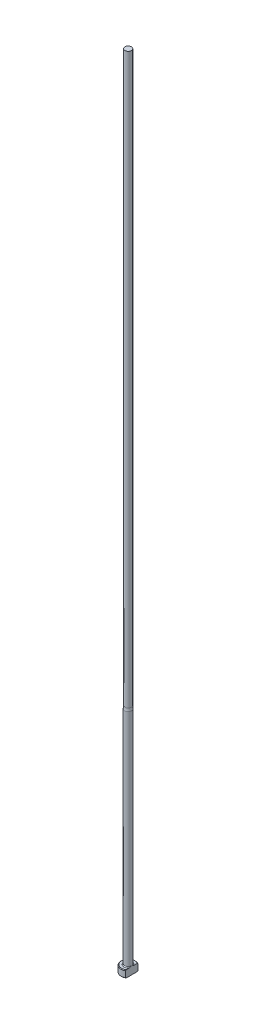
ISO-10303-21;
HEADER;
FILE_DESCRIPTION(('STEP AP214'),'2;1');
FILE_NAME('part.step','',(''),(''),'','','');
FILE_SCHEMA(('AUTOMOTIVE_DESIGN { 1 0 10303 214 1 1 1 1 }'));
ENDSEC;
DATA;
#1=APPLICATION_CONTEXT('core data for automotive mechanical design processes');
#2=APPLICATION_PROTOCOL_DEFINITION('international standard','automotive_design',2000,#1);
#3=PRODUCT_CONTEXT('',#1,'mechanical');
#4=PRODUCT('Part','Part','',(#3));
#5=PRODUCT_RELATED_PRODUCT_CATEGORY('part','',(#4));
#6=PRODUCT_DEFINITION_FORMATION('','',#4);
#7=PRODUCT_DEFINITION_CONTEXT('part definition',#1,'design');
#8=PRODUCT_DEFINITION('design','',#6,#7);
#9=PRODUCT_DEFINITION_SHAPE('','',#8);
#10=(LENGTH_UNIT() NAMED_UNIT(*) SI_UNIT(.MILLI.,.METRE.));
#11=(NAMED_UNIT(*) PLANE_ANGLE_UNIT() SI_UNIT($,.RADIAN.));
#12=(NAMED_UNIT(*) SI_UNIT($,.STERADIAN.) SOLID_ANGLE_UNIT());
#13=UNCERTAINTY_MEASURE_WITH_UNIT(LENGTH_MEASURE(1.E-05),#10,'distance_accuracy_value','');
#14=(GEOMETRIC_REPRESENTATION_CONTEXT(3) GLOBAL_UNCERTAINTY_ASSIGNED_CONTEXT((#13)) GLOBAL_UNIT_ASSIGNED_CONTEXT((#10,
#11,#12)) REPRESENTATION_CONTEXT('',''));
#15=CARTESIAN_POINT('',(0.,0.,0.));
#16=DIRECTION('',(0.,0.,1.));
#17=DIRECTION('',(1.,0.,0.));
#18=AXIS2_PLACEMENT_3D('',#15,#16,#17);
#19=CARTESIAN_POINT('',(-3.17499999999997,3.175,0.));
#20=DIRECTION('',(0.,1.,0.));
#21=DIRECTION('',(0.,0.,1.));
#22=AXIS2_PLACEMENT_3D('',#19,#20,#21);
#23=PLANE('',#22);
#24=CARTESIAN_POINT('',(0.,3.175,0.));
#25=DIRECTION('',(0.,1.,0.));
#26=DIRECTION('',(0.,0.,1.));
#27=AXIS2_PLACEMENT_3D('',#24,#25,#26);
#28=CIRCLE('',#27,2.92099999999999);
#29=CARTESIAN_POINT('',(1.58749999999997,3.175,-2.4519552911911));
#30=VERTEX_POINT('',#29);
#31=CARTESIAN_POINT('',(1.58749999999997,3.175,2.4519552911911));
#32=VERTEX_POINT('',#31);
#33=EDGE_CURVE('E105',#30,#32,#28,.T.);
#34=ORIENTED_EDGE('',*,*,#33,.T.);
#35=DIRECTION('',(0.,0.,1.));
#36=VECTOR('',#35,1.);
#37=CARTESIAN_POINT('',(1.58749999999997,3.17499999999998,2.74963065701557));
#38=LINE('',#37,#36);
#39=CARTESIAN_POINT('',(1.58749999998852,3.175,1.16397422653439));
#40=VERTEX_POINT('',#39);
#41=EDGE_CURVE('E126',#40,#32,#38,.T.);
#42=ORIENTED_EDGE('',*,*,#41,.F.);
#43=CARTESIAN_POINT('',(0.,3.175,0.));
#44=DIRECTION('',(0.,1.,0.));
#45=DIRECTION('',(0.,0.,1.));
#46=AXIS2_PLACEMENT_3D('',#43,#44,#45);
#47=CIRCLE('',#46,1.96849999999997);
#48=CARTESIAN_POINT('',(1.58749999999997,3.175,-1.16397422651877));
#49=VERTEX_POINT('',#48);
#50=EDGE_CURVE('E11',#40,#49,#47,.F.);
#51=ORIENTED_EDGE('',*,*,#50,.T.);
#52=EDGE_CURVE('E52',#30,#49,#38,.T.);
#53=ORIENTED_EDGE('',*,*,#52,.F.);
#54=EDGE_LOOP('',(#34,#42,#51,#53));
#55=FACE_BOUND('',#54,.T.);
#56=ADVANCED_FACE('F32',(#55),#23,.T.);
#57=CARTESIAN_POINT('',(0.,259.958771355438,0.));
#58=DIRECTION('',(0.,1.,0.));
#59=DIRECTION('',(0.,0.,1.));
#60=AXIS2_PLACEMENT_3D('',#57,#58,#59);
#61=CYLINDRICAL_SURFACE('',#60,3.17499999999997);
#62=CARTESIAN_POINT('',(0.,2.92100000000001,0.));
#63=DIRECTION('',(0.,1.,0.));
#64=DIRECTION('',(0.,0.,1.));
#65=AXIS2_PLACEMENT_3D('',#62,#63,#64);
#66=CIRCLE('',#65,3.17499999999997);
#67=CARTESIAN_POINT('',(1.58749999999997,2.92100000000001,2.74963065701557));
#68=VERTEX_POINT('',#67);
#69=CARTESIAN_POINT('',(1.58749999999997,2.92100000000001,-2.74963065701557));
#70=VERTEX_POINT('',#69);
#71=EDGE_CURVE('E98',#68,#70,#66,.F.);
#72=ORIENTED_EDGE('',*,*,#71,.T.);
#73=DIRECTION('',(0.,-1.,0.));
#74=VECTOR('',#73,1.);
#75=CARTESIAN_POINT('',(1.58749999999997,355.601,-2.74963065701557));
#76=LINE('',#75,#74);
#77=CARTESIAN_POINT('',(1.58749999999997,0.253999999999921,-2.74963065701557));
#78=VERTEX_POINT('',#77);
#79=EDGE_CURVE('E141',#70,#78,#76,.T.);
#80=ORIENTED_EDGE('',*,*,#79,.T.);
#81=CARTESIAN_POINT('',(0.,0.253999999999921,0.));
#82=DIRECTION('',(0.,-1.,0.));
#83=DIRECTION('',(0.,0.,-1.));
#84=AXIS2_PLACEMENT_3D('',#81,#82,#83);
#85=CIRCLE('',#84,3.17499999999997);
#86=CARTESIAN_POINT('',(1.58749999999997,0.253999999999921,2.74963065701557));
#87=VERTEX_POINT('',#86);
#88=EDGE_CURVE('E95',#78,#87,#85,.F.);
#89=ORIENTED_EDGE('',*,*,#88,.T.);
#90=DIRECTION('',(0.,-1.,0.));
#91=VECTOR('',#90,1.);
#92=CARTESIAN_POINT('',(1.58749999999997,355.601,2.74963065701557));
#93=LINE('',#92,#91);
#94=EDGE_CURVE('E88',#68,#87,#93,.T.);
#95=ORIENTED_EDGE('',*,*,#94,.F.);
#96=EDGE_LOOP('',(#72,#80,#89,#95));
#97=FACE_BOUND('',#96,.T.);
#98=ADVANCED_FACE('F191',(#97),#61,.T.);
#99=CARTESIAN_POINT('',(0.,0.,0.));
#100=DIRECTION('',(0.,-1.,0.));
#101=DIRECTION('',(0.,0.,-1.));
#102=AXIS2_PLACEMENT_3D('',#99,#100,#101);
#103=PLANE('',#102);
#104=CARTESIAN_POINT('',(0.,0.,0.));
#105=DIRECTION('',(0.,-1.,0.));
#106=DIRECTION('',(0.,0.,-1.));
#107=AXIS2_PLACEMENT_3D('',#104,#105,#106);
#108=CIRCLE('',#107,2.92100000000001);
#109=CARTESIAN_POINT('',(1.58749999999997,0.,2.45195529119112));
#110=VERTEX_POINT('',#109);
#111=CARTESIAN_POINT('',(1.58749999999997,0.,-2.45195529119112));
#112=VERTEX_POINT('',#111);
#113=EDGE_CURVE('E93',#110,#112,#108,.T.);
#114=ORIENTED_EDGE('',*,*,#113,.T.);
#115=DIRECTION('',(0.,0.,1.));
#116=VECTOR('',#115,1.);
#117=CARTESIAN_POINT('',(1.58749999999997,0.,2.74963065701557));
#118=LINE('',#117,#116);
#119=EDGE_CURVE('E78',#112,#110,#118,.T.);
#120=ORIENTED_EDGE('',*,*,#119,.T.);
#121=EDGE_LOOP('',(#114,#120));
#122=FACE_BOUND('',#121,.T.);
#123=ADVANCED_FACE('F97',(#122),#103,.T.);
#124=CARTESIAN_POINT('',(0.,3.17499999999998,0.));
#125=DIRECTION('',(0.,-1.,0.));
#126=DIRECTION('',(0.,0.,-1.));
#127=AXIS2_PLACEMENT_3D('',#124,#125,#126);
#128=CONICAL_SURFACE('',#127,2.92100000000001,0.785398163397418);
#129=ORIENTED_EDGE('',*,*,#71,.F.);
#130=CARTESIAN_POINT('',(1.58749999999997,-0.161620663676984,-6.0529050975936));
#131=CARTESIAN_POINT('',(1.58749999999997,-0.0288893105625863,-5.91567682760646));
#132=CARTESIAN_POINT('',(1.58749999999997,0.103699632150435,-5.77831035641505));
#133=CARTESIAN_POINT('',(1.58749999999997,0.368508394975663,-5.50321874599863));
#134=CARTESIAN_POINT('',(1.58749999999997,0.5007282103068,-5.3654936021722));
#135=CARTESIAN_POINT('',(1.58749999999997,0.764778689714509,-5.08953516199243));
#136=CARTESIAN_POINT('',(1.58749999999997,0.896609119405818,-4.95130164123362));
#137=CARTESIAN_POINT('',(1.58749999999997,1.15968706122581,-4.67428233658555));
#138=CARTESIAN_POINT('',(1.58749999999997,1.29093457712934,-4.5354965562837));
#139=CARTESIAN_POINT('',(1.58749999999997,1.55007705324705,-4.25997724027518));
#140=CARTESIAN_POINT('',(1.58749999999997,1.67798684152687,-4.12325766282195));
#141=CARTESIAN_POINT('',(1.58749999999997,1.9328486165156,-3.84892898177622));
#142=CARTESIAN_POINT('',(1.58749999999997,2.05980060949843,-3.71131988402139));
#143=CARTESIAN_POINT('',(1.58749999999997,2.31237508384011,-3.43493978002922));
#144=CARTESIAN_POINT('',(1.58749999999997,2.43799784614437,-3.29616903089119));
#145=CARTESIAN_POINT('',(1.58749999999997,2.68741369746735,-3.01699558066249));
#146=CARTESIAN_POINT('',(1.58749999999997,2.81120686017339,-2.8765929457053));
#147=CARTESIAN_POINT('',(1.58749999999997,3.00875865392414,-2.64816703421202));
#148=CARTESIAN_POINT('',(1.58749999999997,3.08336151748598,-2.56087478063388));
#149=CARTESIAN_POINT('',(1.58749999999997,3.23123871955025,-2.385154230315));
#150=CARTESIAN_POINT('',(1.58749999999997,3.30451292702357,-2.29672582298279));
#151=CARTESIAN_POINT('',(1.58749999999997,3.45004422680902,-2.11747400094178));
#152=CARTESIAN_POINT('',(1.58749999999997,3.52228237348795,-2.02663514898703));
#153=CARTESIAN_POINT('',(1.58749999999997,3.66423097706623,-1.84302524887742));
#154=CARTESIAN_POINT('',(1.58749999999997,3.73394203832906,-1.75025467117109));
#155=CARTESIAN_POINT('',(1.58749999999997,3.87080633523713,-1.56067475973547));
#156=CARTESIAN_POINT('',(1.58749999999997,3.93790459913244,-1.46382547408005));
#157=CARTESIAN_POINT('',(1.58749999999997,4.06669147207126,-1.26632594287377));
#158=CARTESIAN_POINT('',(1.58749999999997,4.12837264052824,-1.16567073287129));
#159=CARTESIAN_POINT('',(1.58749999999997,4.21402252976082,-1.01165766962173));
#160=CARTESIAN_POINT('',(1.58749999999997,4.2412792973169,-0.960142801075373));
#161=CARTESIAN_POINT('',(1.58749999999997,4.29309798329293,-0.85578092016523));
#162=CARTESIAN_POINT('',(1.58749999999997,4.3176594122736,-0.802933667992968));
#163=CARTESIAN_POINT('',(1.58749999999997,4.38614656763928,-0.642461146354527));
#164=CARTESIAN_POINT('',(1.58749999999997,4.42510149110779,-0.532518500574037));
#165=CARTESIAN_POINT('',(1.58749999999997,4.46726244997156,-0.367680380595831));
#166=CARTESIAN_POINT('',(1.58749999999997,4.47844427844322,-0.314802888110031));
#167=CARTESIAN_POINT('',(1.58749999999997,4.49576654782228,-0.208209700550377));
#168=CARTESIAN_POINT('',(1.58749999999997,4.50190743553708,-0.154494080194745));
#169=CARTESIAN_POINT('',(1.58749999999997,4.50871296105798,-0.0468792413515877));
#170=CARTESIAN_POINT('',(1.58749999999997,4.50939451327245,0.00701889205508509));
#171=CARTESIAN_POINT('',(1.58749999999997,4.5052767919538,0.114606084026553));
#172=CARTESIAN_POINT('',(1.58749999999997,4.5004770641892,0.16829512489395));
#173=CARTESIAN_POINT('',(1.58749999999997,4.48579689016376,0.274485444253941));
#174=CARTESIAN_POINT('',(1.58749999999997,4.47596081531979,0.326992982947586));
#175=CARTESIAN_POINT('',(1.58749999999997,4.4518180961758,0.430974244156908));
#176=CARTESIAN_POINT('',(1.58749999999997,4.43750969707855,0.482447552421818));
#177=CARTESIAN_POINT('',(1.58749999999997,4.40502489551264,0.58446088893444));
#178=CARTESIAN_POINT('',(1.58749999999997,4.38682724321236,0.634994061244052));
#179=CARTESIAN_POINT('',(1.58749999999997,4.34729308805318,0.734789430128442));
#180=CARTESIAN_POINT('',(1.58749999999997,4.32595722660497,0.784051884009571));
#181=CARTESIAN_POINT('',(1.58749999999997,4.25791922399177,0.93054934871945));
#182=CARTESIAN_POINT('',(1.58749999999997,4.20736047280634,1.02598802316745));
#183=CARTESIAN_POINT('',(1.58749999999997,4.09955451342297,1.21304313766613));
#184=CARTESIAN_POINT('',(1.58749999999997,4.04229912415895,1.30465471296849));
#185=CARTESIAN_POINT('',(1.58749999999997,3.92308746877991,1.48526211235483));
#186=CARTESIAN_POINT('',(1.58749999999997,3.86111349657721,1.57424615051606));
#187=CARTESIAN_POINT('',(1.58749999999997,3.73408621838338,1.74990003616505));
#188=CARTESIAN_POINT('',(1.58749999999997,3.66903444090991,1.83657099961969));
#189=CARTESIAN_POINT('',(1.58749999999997,3.53583371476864,2.009317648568));
#190=CARTESIAN_POINT('',(1.58749999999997,3.46765527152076,2.09537048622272));
#191=CARTESIAN_POINT('',(1.58749999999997,3.32960643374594,2.26611736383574));
#192=CARTESIAN_POINT('',(1.58749999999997,3.25973586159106,2.35081125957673));
#193=CARTESIAN_POINT('',(1.58749999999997,3.04858139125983,2.60290121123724));
#194=CARTESIAN_POINT('',(1.58749999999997,2.90542388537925,2.7687253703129));
#195=CARTESIAN_POINT('',(1.58749999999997,2.64069522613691,3.06970913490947));
#196=CARTESIAN_POINT('',(1.58749999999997,2.5195945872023,3.20528660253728));
#197=CARTESIAN_POINT('',(1.58749999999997,2.27590400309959,3.47510321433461));
#198=CARTESIAN_POINT('',(1.58749999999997,2.1533140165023,3.60934232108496));
#199=CARTESIAN_POINT('',(1.58749999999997,1.9069423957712,3.87695374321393));
#200=CARTESIAN_POINT('',(1.58749999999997,1.78315974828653,4.01032512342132));
#201=CARTESIAN_POINT('',(1.58749999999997,1.53478104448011,4.2763088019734));
#202=CARTESIAN_POINT('',(1.58749999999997,1.41018498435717,4.40892109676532));
#203=CARTESIAN_POINT('',(1.58749999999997,1.04574684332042,4.79499418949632));
#204=CARTESIAN_POINT('',(1.58749999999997,0.805076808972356,5.04767313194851));
#205=CARTESIAN_POINT('',(1.58749999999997,0.44312150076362,5.42550911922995));
#206=CARTESIAN_POINT('',(1.58749999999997,0.322378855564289,5.55118772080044));
#207=CARTESIAN_POINT('',(1.58749999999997,0.0805914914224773,5.8022520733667));
#208=CARTESIAN_POINT('',(1.58749999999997,-0.0404532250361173,5.92763782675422));
#209=CARTESIAN_POINT('',(1.58749999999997,-0.161620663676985,6.0529050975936));
#210=B_SPLINE_CURVE_WITH_KNOTS('',3,(#130,#131,#132,#133,#134,#135,#136,#137,#138,#139,#140,
#141,#142,#143,#144,#145,#146,#147,#148,#149,#150,#151,#152,#153,#154,#155,#156,#157,#158,#159,
#160,#161,#162,#163,#164,#165,#166,#167,#168,#169,#170,#171,#172,#173,#174,#175,#176,#177,#178,
#179,#180,#181,#182,#183,#184,#185,#186,#187,#188,#189,#190,#191,#192,#193,#194,#195,#196,#197,
#198,#199,#200,#201,#202,#203,#204,#205,#206,#207,#208,#209),.UNSPECIFIED.,.F.,.F.,(4,2,2,2,2,2,
2,2,2,2,2,2,2,2,2,2,2,2,2,2,2,2,2,2,2,2,2,2,2,2,2,2,2,2,2,2,2,2,2,4),(0.,0.572750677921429,
1.14550874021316,1.71856057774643,2.29160869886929,2.85328006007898,3.41494773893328,
3.97649423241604,4.53801804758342,4.88249307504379,5.2270018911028,5.57515326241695,
5.92322081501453,6.27657800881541,6.63041319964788,6.80518126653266,6.97998101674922,
7.32824262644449,7.49018491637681,7.65211285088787,7.81353889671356,7.97497832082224,
8.13501929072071,8.29512313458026,8.45612518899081,8.61709438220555,8.94062993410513,
9.26456495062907,9.58978187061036,9.91483894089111,10.2441741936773,10.5735441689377,
11.2306812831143,11.7760337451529,12.3214014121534,12.8672825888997,13.4131663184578,
14.4600164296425,14.9828595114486,15.505698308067),.UNSPECIFIED.);
#211=EDGE_CURVE('E118',#32,#68,#210,.T.);
#212=ORIENTED_EDGE('',*,*,#211,.F.);
#213=ORIENTED_EDGE('',*,*,#33,.F.);
#214=EDGE_CURVE('E117',#70,#30,#210,.T.);
#215=ORIENTED_EDGE('',*,*,#214,.F.);
#216=EDGE_LOOP('',(#129,#212,#213,#215));
#217=FACE_BOUND('',#216,.T.);
#218=ADVANCED_FACE('F162',(#217),#128,.T.);
#219=CARTESIAN_POINT('',(0.,0.253999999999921,0.));
#220=DIRECTION('',(0.,1.,0.));
#221=DIRECTION('',(0.,0.,1.));
#222=AXIS2_PLACEMENT_3D('',#219,#220,#221);
#223=CONICAL_SURFACE('',#222,3.17499999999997,0.785398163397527);
#224=ORIENTED_EDGE('',*,*,#88,.F.);
#225=CARTESIAN_POINT('',(1.58749999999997,3.33662066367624,6.0529050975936));
#226=CARTESIAN_POINT('',(1.58749999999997,3.20388931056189,5.91567682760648));
#227=CARTESIAN_POINT('',(1.58749999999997,3.07130036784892,5.7783103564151));
#228=CARTESIAN_POINT('',(1.58749999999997,2.80649160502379,5.50321874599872));
#229=CARTESIAN_POINT('',(1.58749999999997,2.6742717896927,5.36549360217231));
#230=CARTESIAN_POINT('',(1.58749999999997,2.41022131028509,5.08953516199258));
#231=CARTESIAN_POINT('',(1.58749999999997,2.27839088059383,4.95130164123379));
#232=CARTESIAN_POINT('',(1.58749999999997,2.01531293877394,4.67428233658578));
#233=CARTESIAN_POINT('',(1.58749999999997,1.88406542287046,4.53549655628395));
#234=CARTESIAN_POINT('',(1.58749999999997,1.62492294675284,4.25997724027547));
#235=CARTESIAN_POINT('',(1.58749999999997,1.49701315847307,4.12325766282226));
#236=CARTESIAN_POINT('',(1.58749999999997,1.24215138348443,3.84892898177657));
#237=CARTESIAN_POINT('',(1.58749999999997,1.11519939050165,3.71131988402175));
#238=CARTESIAN_POINT('',(1.58749999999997,0.862624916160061,3.43493978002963));
#239=CARTESIAN_POINT('',(1.58749999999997,0.737002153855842,3.29616903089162));
#240=CARTESIAN_POINT('',(1.58749999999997,0.487586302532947,3.01699558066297));
#241=CARTESIAN_POINT('',(1.58749999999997,0.363793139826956,2.8765929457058));
#242=CARTESIAN_POINT('',(1.58749999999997,0.166241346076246,2.64816703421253));
#243=CARTESIAN_POINT('',(1.58749999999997,0.0916384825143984,2.56087478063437));
#244=CARTESIAN_POINT('',(1.58749999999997,-0.0562387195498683,2.38515423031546));
#245=CARTESIAN_POINT('',(1.58749999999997,-0.129512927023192,2.29672582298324));
#246=CARTESIAN_POINT('',(1.58749999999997,-0.275044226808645,2.1174740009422));
#247=CARTESIAN_POINT('',(1.58749999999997,-0.347282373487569,2.02663514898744));
#248=CARTESIAN_POINT('',(1.58749999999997,-0.489230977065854,1.8430252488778));
#249=CARTESIAN_POINT('',(1.58749999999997,-0.558942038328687,1.75025467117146));
#250=CARTESIAN_POINT('',(1.58749999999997,-0.695806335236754,1.5606747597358));
#251=CARTESIAN_POINT('',(1.58749999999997,-0.762904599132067,1.46382547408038));
#252=CARTESIAN_POINT('',(1.58749999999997,-0.89169147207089,1.26632594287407));
#253=CARTESIAN_POINT('',(1.58749999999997,-0.953372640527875,1.16567073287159));
#254=CARTESIAN_POINT('',(1.58749999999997,-1.03902252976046,1.01165766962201));
#255=CARTESIAN_POINT('',(1.58749999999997,-1.06627929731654,0.960142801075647));
#256=CARTESIAN_POINT('',(1.58749999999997,-1.11809798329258,0.855780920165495));
#257=CARTESIAN_POINT('',(1.58749999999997,-1.14265941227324,0.802933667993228));
#258=CARTESIAN_POINT('',(1.58749999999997,-1.21114656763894,0.642461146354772));
#259=CARTESIAN_POINT('',(1.58749999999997,-1.25010149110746,0.532518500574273));
#260=CARTESIAN_POINT('',(1.58749999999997,-1.29226244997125,0.367680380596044));
#261=CARTESIAN_POINT('',(1.58749999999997,-1.30344427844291,0.314802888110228));
#262=CARTESIAN_POINT('',(1.58749999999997,-1.32076654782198,0.208209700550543));
#263=CARTESIAN_POINT('',(1.58749999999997,-1.32690743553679,0.154494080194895));
#264=CARTESIAN_POINT('',(1.58749999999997,-1.3337129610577,0.0468792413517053));
#265=CARTESIAN_POINT('',(1.58749999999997,-1.33439451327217,-0.00701889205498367));
#266=CARTESIAN_POINT('',(1.58749999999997,-1.33027679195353,-0.114606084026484));
#267=CARTESIAN_POINT('',(1.58749999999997,-1.32547706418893,-0.168295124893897));
#268=CARTESIAN_POINT('',(1.58749999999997,-1.31079689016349,-0.274485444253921));
#269=CARTESIAN_POINT('',(1.58749999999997,-1.30096081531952,-0.326992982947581));
#270=CARTESIAN_POINT('',(1.58749999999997,-1.27681809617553,-0.430974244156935));
#271=CARTESIAN_POINT('',(1.58749999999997,-1.26250969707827,-0.48244755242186));
#272=CARTESIAN_POINT('',(1.58749999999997,-1.23002489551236,-0.584460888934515));
#273=CARTESIAN_POINT('',(1.58749999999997,-1.21182724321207,-0.634994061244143));
#274=CARTESIAN_POINT('',(1.58749999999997,-1.17229308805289,-0.734789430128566));
#275=CARTESIAN_POINT('',(1.58749999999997,-1.15095722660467,-0.784051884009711));
#276=CARTESIAN_POINT('',(1.58749999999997,-1.08291922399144,-0.930549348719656));
#277=CARTESIAN_POINT('',(1.58749999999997,-1.03236047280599,-1.0259880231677));
#278=CARTESIAN_POINT('',(1.58749999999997,-0.924554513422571,-1.21304313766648));
#279=CARTESIAN_POINT('',(1.58749999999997,-0.867299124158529,-1.30465471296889));
#280=CARTESIAN_POINT('',(1.58749999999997,-0.748087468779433,-1.48526211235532));
#281=CARTESIAN_POINT('',(1.58749999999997,-0.686113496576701,-1.5742461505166));
#282=CARTESIAN_POINT('',(1.58749999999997,-0.559086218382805,-1.74990003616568));
#283=CARTESIAN_POINT('',(1.58749999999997,-0.494034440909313,-1.83657099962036));
#284=CARTESIAN_POINT('',(1.58749999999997,-0.360833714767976,-2.00931764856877));
#285=CARTESIAN_POINT('',(1.58749999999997,-0.292655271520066,-2.09537048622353));
#286=CARTESIAN_POINT('',(1.58749999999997,-0.154606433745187,-2.26611736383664));
#287=CARTESIAN_POINT('',(1.58749999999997,-0.0847358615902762,-2.35081125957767));
#288=CARTESIAN_POINT('',(1.58749999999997,0.126418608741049,-2.60290121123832));
#289=CARTESIAN_POINT('',(1.58749999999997,0.269576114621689,-2.76872537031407));
#290=CARTESIAN_POINT('',(1.58749999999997,0.534304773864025,-3.06970913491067));
#291=CARTESIAN_POINT('',(1.58749999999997,0.655405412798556,-3.20528660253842));
#292=CARTESIAN_POINT('',(1.58749999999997,0.899095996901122,-3.47510321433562));
#293=CARTESIAN_POINT('',(1.58749999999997,1.02168598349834,-3.60934232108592));
#294=CARTESIAN_POINT('',(1.58749999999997,1.26805760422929,-3.87695374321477));
#295=CARTESIAN_POINT('',(1.58749999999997,1.39184025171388,-4.0103251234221));
#296=CARTESIAN_POINT('',(1.58749999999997,1.64021895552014,-4.27630880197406));
#297=CARTESIAN_POINT('',(1.58749999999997,1.76481501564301,-4.40892109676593));
#298=CARTESIAN_POINT('',(1.58749999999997,2.12925315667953,-4.79499418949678));
#299=CARTESIAN_POINT('',(1.58749999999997,2.36992319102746,-5.04767313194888));
#300=CARTESIAN_POINT('',(1.58749999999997,2.73187849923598,-5.42550911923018));
#301=CARTESIAN_POINT('',(1.58749999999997,2.85262114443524,-5.55118772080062));
#302=CARTESIAN_POINT('',(1.58749999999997,3.09440850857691,-5.80225207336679));
#303=CARTESIAN_POINT('',(1.58749999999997,3.21545322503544,-5.92763782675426));
#304=CARTESIAN_POINT('',(1.58749999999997,3.33662066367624,-6.0529050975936));
#305=B_SPLINE_CURVE_WITH_KNOTS('',3,(#225,#226,#227,#228,#229,#230,#231,#232,#233,#234,#235,
#236,#237,#238,#239,#240,#241,#242,#243,#244,#245,#246,#247,#248,#249,#250,#251,#252,#253,#254,
#255,#256,#257,#258,#259,#260,#261,#262,#263,#264,#265,#266,#267,#268,#269,#270,#271,#272,#273,
#274,#275,#276,#277,#278,#279,#280,#281,#282,#283,#284,#285,#286,#287,#288,#289,#290,#291,#292,
#293,#294,#295,#296,#297,#298,#299,#300,#301,#302,#303,#304),.UNSPECIFIED.,.F.,.F.,(4,2,2,2,2,2,
2,2,2,2,2,2,2,2,2,2,2,2,2,2,2,2,2,2,2,2,2,2,2,2,2,2,2,2,2,2,2,2,2,4),(0.,0.572750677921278,
1.14550874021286,1.71856057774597,2.29160869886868,2.85328006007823,3.4149477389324,
3.97649423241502,4.53801804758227,4.88249307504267,5.22700189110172,5.5751532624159,
5.92322081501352,6.27657800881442,6.63041319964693,6.80518126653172,6.9799810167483,
7.3282426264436,7.49018491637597,7.65211285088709,7.81353889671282,7.97497832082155,
8.13501929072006,8.29512313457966,8.45612518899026,8.61709438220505,8.9406299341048,
9.2645649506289,9.58978187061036,9.91483894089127,10.2441741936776,10.5735441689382,
11.2306812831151,11.7760337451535,12.3214014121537,12.8672825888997,13.4131663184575,
14.4600164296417,14.9828595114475,15.5056983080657),.UNSPECIFIED.);
#306=EDGE_CURVE('E81',#112,#78,#305,.T.);
#307=ORIENTED_EDGE('',*,*,#306,.F.);
#308=ORIENTED_EDGE('',*,*,#113,.F.);
#309=EDGE_CURVE('E84',#87,#110,#305,.T.);
#310=ORIENTED_EDGE('',*,*,#309,.F.);
#311=EDGE_LOOP('',(#224,#307,#308,#310));
#312=FACE_BOUND('',#311,.T.);
#313=ADVANCED_FACE('F92',(#312),#223,.T.);
#314=CARTESIAN_POINT('',(0.,3.556,0.));
#315=DIRECTION('',(0.,1.,0.));
#316=DIRECTION('',(0.,0.,1.));
#317=AXIS2_PLACEMENT_3D('',#314,#315,#316);
#318=TOROIDAL_SURFACE('',#317,1.96849999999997,0.381);
#319=CARTESIAN_POINT('',(1.58749999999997,3.556,0.));
#320=CARTESIAN_POINT('',(1.58749999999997,3.55599928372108,-9.72839998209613E-12));
#321=CARTESIAN_POINT('',(1.58749999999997,3.55599856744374,-1.16390048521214E-07));
#322=CARTESIAN_POINT('',(1.58749999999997,3.55599717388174,-5.02802253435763E-07));
#323=CARTESIAN_POINT('',(1.58749999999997,3.55599649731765,-7.75049116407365E-07));
#324=CARTESIAN_POINT('',(1.58749999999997,3.55599515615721,-1.43578185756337E-06));
#325=CARTESIAN_POINT('',(1.58749999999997,3.55599449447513,-1.83004116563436E-06));
#326=CARTESIAN_POINT('',(1.58749999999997,3.55599322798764,-2.69326525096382E-06));
#327=CARTESIAN_POINT('',(1.58749999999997,3.55599262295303,-3.16190628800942E-06));
#328=CARTESIAN_POINT('',(1.58749999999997,3.55599066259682,-4.80183833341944E-06));
#329=CARTESIAN_POINT('',(1.58749999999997,3.55598938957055,-6.07237548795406E-06));
#330=CARTESIAN_POINT('',(1.58749999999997,3.55598706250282,-8.74131694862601E-06));
#331=CARTESIAN_POINT('',(1.58749999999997,3.55598600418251,-1.01362054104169E-05));
#332=CARTESIAN_POINT('',(1.58749999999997,3.55598220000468,-1.54025644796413E-05));
#333=CARTESIAN_POINT('',(1.58749999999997,3.55597966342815,-1.94297992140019E-05));
#334=CARTESIAN_POINT('',(1.58749999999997,3.55597535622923,-2.75116574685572E-05));
#335=CARTESIAN_POINT('',(1.58749999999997,3.55597354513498,-3.15456374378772E-05));
#336=CARTESIAN_POINT('',(1.58749999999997,3.55596616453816,-4.82039076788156E-05));
#337=CARTESIAN_POINT('',(1.58749999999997,3.55596077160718,-6.08993138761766E-05));
#338=CARTESIAN_POINT('',(1.58749999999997,3.55595181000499,-8.49758225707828E-05));
#339=CARTESIAN_POINT('',(1.58749999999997,3.55594809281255,-9.6299831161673E-05));
#340=CARTESIAN_POINT('',(1.58749999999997,3.55591954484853,-0.000176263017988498));
#341=CARTESIAN_POINT('',(1.58749999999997,3.55588430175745,-0.000240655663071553));
#342=CARTESIAN_POINT('',(1.58749999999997,3.55575419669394,-0.000487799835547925));
#343=CARTESIAN_POINT('',(1.58749999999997,3.55566706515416,-0.000673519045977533));
#344=CARTESIAN_POINT('',(1.58749999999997,3.55532896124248,-0.00138308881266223));
#345=CARTESIAN_POINT('',(1.58749999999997,3.55506990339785,-0.0019038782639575));
#346=CARTESIAN_POINT('',(1.58749999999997,3.55403272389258,-0.00399959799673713));
#347=CARTESIAN_POINT('',(1.58749999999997,3.55326363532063,-0.0055779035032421));
#348=CARTESIAN_POINT('',(1.58749999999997,3.53734419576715,-0.0382341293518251));
#349=CARTESIAN_POINT('',(1.58749999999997,3.52209124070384,-0.0692744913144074));
#350=CARTESIAN_POINT('',(1.58749999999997,3.49234031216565,-0.130397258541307));
#351=CARTESIAN_POINT('',(1.58749999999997,3.4778343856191,-0.160476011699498));
#352=CARTESIAN_POINT('',(1.58749999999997,3.44756579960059,-0.22405302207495));
#353=CARTESIAN_POINT('',(1.58749999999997,3.43183768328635,-0.257567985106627));
#354=CARTESIAN_POINT('',(1.58749999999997,3.40084315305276,-0.325196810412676));
#355=CARTESIAN_POINT('',(1.58749999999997,3.38558252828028,-0.359313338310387));
#356=CARTESIAN_POINT('',(1.58749999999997,3.35947844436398,-0.419670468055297));
#357=CARTESIAN_POINT('',(1.58749999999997,3.34845502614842,-0.445832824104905));
#358=CARTESIAN_POINT('',(1.58749999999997,3.32703860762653,-0.498343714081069));
#359=CARTESIAN_POINT('',(1.58749999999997,3.31664422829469,-0.52469168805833));
#360=CARTESIAN_POINT('',(1.58749999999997,3.2869407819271,-0.603098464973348));
#361=CARTESIAN_POINT('',(1.58749999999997,3.26865317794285,-0.655557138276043));
#362=CARTESIAN_POINT('',(1.58749999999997,3.24332469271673,-0.737608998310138));
#363=CARTESIAN_POINT('',(1.58749999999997,3.23494346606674,-0.766787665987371));
#364=CARTESIAN_POINT('',(1.58749999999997,3.21949479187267,-0.825628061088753));
#365=CARTESIAN_POINT('',(1.58749999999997,3.21243348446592,-0.855291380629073));
#366=CARTESIAN_POINT('',(1.58749999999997,3.19303275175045,-0.947623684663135));
#367=CARTESIAN_POINT('',(1.58749999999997,3.18336484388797,-1.01091582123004));
#368=CARTESIAN_POINT('',(1.58749999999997,3.17464826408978,-1.12491727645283));
#369=CARTESIAN_POINT('',(1.58749999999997,3.17379742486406,-1.17548103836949));
#370=CARTESIAN_POINT('',(1.58749999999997,3.17980825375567,-1.2756075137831));
#371=CARTESIAN_POINT('',(1.58749999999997,3.18656467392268,-1.32517446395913));
#372=CARTESIAN_POINT('',(1.58749999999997,3.20510062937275,-1.40268723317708));
#373=CARTESIAN_POINT('',(1.58749999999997,3.21379930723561,-1.43136704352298));
#374=CARTESIAN_POINT('',(1.58749999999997,3.23523847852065,-1.48727388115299));
#375=CARTESIAN_POINT('',(1.58749999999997,3.24798385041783,-1.51449910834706));
#376=CARTESIAN_POINT('',(1.58749999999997,3.27479889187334,-1.56082978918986));
#377=CARTESIAN_POINT('',(1.58749999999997,3.2880084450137,-1.5804296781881));
#378=CARTESIAN_POINT('',(1.58749999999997,3.31738741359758,-1.61726850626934));
#379=CARTESIAN_POINT('',(1.58749999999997,3.33355126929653,-1.63451177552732));
#380=CARTESIAN_POINT('',(1.58749999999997,3.3650209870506,-1.66235366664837));
#381=CARTESIAN_POINT('',(1.58749999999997,3.37976591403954,-1.67358404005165));
#382=CARTESIAN_POINT('',(1.58749999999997,3.41090649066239,-1.69348690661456));
#383=CARTESIAN_POINT('',(1.58749999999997,3.42730148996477,-1.70216040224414));
#384=CARTESIAN_POINT('',(1.58749999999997,3.46152587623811,-1.71647536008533));
#385=CARTESIAN_POINT('',(1.58749999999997,3.47936500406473,-1.72209384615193));
#386=CARTESIAN_POINT('',(1.58749999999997,3.51579449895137,-1.72977101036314));
#387=CARTESIAN_POINT('',(1.58749999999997,3.53438431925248,-1.73183223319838));
#388=CARTESIAN_POINT('',(1.58749999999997,3.5693049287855,-1.73220894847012));
#389=CARTESIAN_POINT('',(1.58749999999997,3.58563247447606,-1.73095378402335));
#390=CARTESIAN_POINT('',(1.58749999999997,3.61782719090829,-1.72566824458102));
#391=CARTESIAN_POINT('',(1.58749999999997,3.6336944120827,-1.72163817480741));
#392=CARTESIAN_POINT('',(1.58749999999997,3.66430913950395,-1.71112762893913));
#393=CARTESIAN_POINT('',(1.58749999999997,3.67907021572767,-1.70468621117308));
#394=CARTESIAN_POINT('',(1.58749999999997,3.7074589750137,-1.68967506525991));
#395=CARTESIAN_POINT('',(1.58749999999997,3.72108625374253,-1.68110458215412));
#396=CARTESIAN_POINT('',(1.58749999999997,3.75190835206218,-1.6586320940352));
#397=CARTESIAN_POINT('',(1.58749999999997,3.76852524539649,-1.64393589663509));
#398=CARTESIAN_POINT('',(1.58749999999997,3.79915076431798,-1.61203006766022));
#399=CARTESIAN_POINT('',(1.58749999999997,3.81315342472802,-1.59481484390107));
#400=CARTESIAN_POINT('',(1.58749999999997,3.84335302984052,-1.55180967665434));
#401=CARTESIAN_POINT('',(1.58749999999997,3.85840997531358,-1.52522183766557));
#402=CARTESIAN_POINT('',(1.58749999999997,3.8840928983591,-1.47008223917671));
#403=CARTESIAN_POINT('',(1.58749999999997,3.89472145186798,-1.44153163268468));
#404=CARTESIAN_POINT('',(1.58749999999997,3.91656912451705,-1.36850699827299));
#405=CARTESIAN_POINT('',(1.58749999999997,3.92534811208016,-1.32330828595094));
#406=CARTESIAN_POINT('',(1.58749999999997,3.93598980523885,-1.23163561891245));
#407=CARTESIAN_POINT('',(1.58749999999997,3.93776012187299,-1.18515271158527));
#408=CARTESIAN_POINT('',(1.58749999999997,3.93485724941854,-1.056626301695));
#409=CARTESIAN_POINT('',(1.58749999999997,3.9241811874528,-0.974728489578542));
#410=CARTESIAN_POINT('',(1.58749999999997,3.899893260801,-0.855941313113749));
#411=CARTESIAN_POINT('',(1.58749999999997,3.89075037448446,-0.817952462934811));
#412=CARTESIAN_POINT('',(1.58749999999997,3.87034922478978,-0.742758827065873));
#413=CARTESIAN_POINT('',(1.58749999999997,3.85910312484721,-0.705550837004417));
#414=CARTESIAN_POINT('',(1.58749999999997,3.83067738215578,-0.618900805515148));
#415=CARTESIAN_POINT('',(1.58749999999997,3.81279292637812,-0.56969368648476));
#416=CARTESIAN_POINT('',(1.58749999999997,3.78404415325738,-0.496059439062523));
#417=CARTESIAN_POINT('',(1.58749999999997,3.77402894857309,-0.471293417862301));
#418=CARTESIAN_POINT('',(1.58749999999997,3.75347166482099,-0.421913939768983));
#419=CARTESIAN_POINT('',(1.58749999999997,3.74292842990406,-0.39730096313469));
#420=CARTESIAN_POINT('',(1.58749999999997,3.71797467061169,-0.340371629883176));
#421=CARTESIAN_POINT('',(1.58749999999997,3.7034106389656,-0.308122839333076));
#422=CARTESIAN_POINT('',(1.58749999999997,3.67389634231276,-0.244169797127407));
#423=CARTESIAN_POINT('',(1.58749999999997,3.65895097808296,-0.212463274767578));
#424=CARTESIAN_POINT('',(1.58749999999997,3.63022587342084,-0.152300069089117));
#425=CARTESIAN_POINT('',(1.58749999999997,3.61647532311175,-0.123829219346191));
#426=CARTESIAN_POINT('',(1.58749999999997,3.58829058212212,-0.065967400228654));
#427=CARTESIAN_POINT('',(1.58749999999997,3.57384944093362,-0.036579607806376));
#428=CARTESIAN_POINT('',(1.58749999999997,3.55873641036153,-0.00557801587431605));
#429=CARTESIAN_POINT('',(1.58749999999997,3.557967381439,-0.00399981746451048));
#430=CARTESIAN_POINT('',(1.58749999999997,3.55693021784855,-0.00190412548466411));
#431=CARTESIAN_POINT('',(1.58749999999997,3.55667111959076,-0.00138325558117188));
#432=CARTESIAN_POINT('',(1.58749999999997,3.55633296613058,-0.00067358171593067));
#433=CARTESIAN_POINT('',(1.58749999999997,3.55624582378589,-0.000487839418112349));
#434=CARTESIAN_POINT('',(1.58749999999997,3.55611570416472,-0.000240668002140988));
#435=CARTESIAN_POINT('',(1.58749999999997,3.55608045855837,-0.000176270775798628));
#436=CARTESIAN_POINT('',(1.58749999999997,3.55605190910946,-9.63021903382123E-05));
#437=CARTESIAN_POINT('',(1.58749999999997,3.55604819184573,-8.49777827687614E-05));
#438=CARTESIAN_POINT('',(1.58749999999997,3.55603922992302,-6.09004217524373E-05));
#439=CARTESIAN_POINT('',(1.58749999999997,3.55603383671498,-4.82045726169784E-05));
#440=CARTESIAN_POINT('',(1.58749999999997,3.55602645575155,-3.15458034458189E-05));
#441=CARTESIAN_POINT('',(1.58749999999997,3.55602464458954,-2.75117552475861E-05));
#442=CARTESIAN_POINT('',(1.58749999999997,3.55602033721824,-1.94297725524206E-05));
#443=CARTESIAN_POINT('',(1.58749999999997,3.55601780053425,-1.54024835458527E-05));
#444=CARTESIAN_POINT('',(1.58749999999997,3.55601399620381,-1.01360754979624E-05));
#445=CARTESIAN_POINT('',(1.58749999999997,3.55601293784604,-8.7411813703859E-06));
#446=CARTESIAN_POINT('',(1.58749999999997,3.55601061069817,-6.07223627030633E-06));
#447=CARTESIAN_POINT('',(1.58749999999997,3.55600933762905,-4.80170138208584E-06));
#448=CARTESIAN_POINT('',(1.58749999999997,3.55600737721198,-3.16178168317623E-06));
#449=CARTESIAN_POINT('',(1.58749999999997,3.55600677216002,-2.69314602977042E-06));
#450=CARTESIAN_POINT('',(1.58749999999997,3.55600550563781,-1.82993577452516E-06));
#451=CARTESIAN_POINT('',(1.58749999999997,3.55600484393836,-1.43568493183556E-06));
#452=CARTESIAN_POINT('',(1.58749999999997,3.55600350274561,-7.74972790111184E-07));
#453=CARTESIAN_POINT('',(1.58749999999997,3.55600282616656,-5.02737772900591E-07));
#454=CARTESIAN_POINT('',(1.58749999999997,3.55600143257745,-1.16354060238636E-07));
#455=CARTESIAN_POINT('',(1.58749999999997,3.55600071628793,9.72852226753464E-12));
#456=CARTESIAN_POINT('',(1.58749999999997,3.556,0.));
#457=B_SPLINE_CURVE_WITH_KNOTS('',3,(#319,#320,#321,#322,#323,#324,#325,#326,#327,#328,#329,
#330,#331,#332,#333,#334,#335,#336,#337,#338,#339,#340,#341,#342,#343,#344,#345,#346,#347,#348,
#349,#350,#351,#352,#353,#354,#355,#356,#357,#358,#359,#360,#361,#362,#363,#364,#365,#366,#367,
#368,#369,#370,#371,#372,#373,#374,#375,#376,#377,#378,#379,#380,#381,#382,#383,#384,#385,#386,
#387,#388,#389,#390,#391,#392,#393,#394,#395,#396,#397,#398,#399,#400,#401,#402,#403,#404,#405,
#406,#407,#408,#409,#410,#411,#412,#413,#414,#415,#416,#417,#418,#419,#420,#421,#422,#423,#424,
#425,#426,#427,#428,#429,#430,#431,#432,#433,#434,#435,#436,#437,#438,#439,#440,#441,#442,#443,
#444,#445,#446,#447,#448,#449,#450,#451,#452,#453,#454,#455,#456),.UNSPECIFIED.,.T.,.F.,(4,2,2,
2,2,2,2,2,2,2,2,2,2,2,2,2,2,2,2,2,2,2,2,2,2,2,2,2,2,2,2,2,2,2,2,2,2,2,2,2,2,2,2,2,2,2,2,2,2,2,2,
2,2,2,2,2,2,2,2,2,2,2,2,2,2,2,2,2,4),(0.,2.14653634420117E-06,4.3243617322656E-06,
6.62715069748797E-06,8.92017875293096E-06,1.42892293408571E-05,1.95376032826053E-05,
3.37616071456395E-05,4.70144492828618E-05,8.83789092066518E-05,0.000124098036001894,
0.000343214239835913,0.000959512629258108,0.00270343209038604,0.00797166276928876,
0.11171345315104,0.21189766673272,0.322958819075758,0.435072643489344,0.520234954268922,
0.605203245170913,0.771741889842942,0.862787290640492,0.954246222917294,1.14571222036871,
1.29701464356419,1.44624921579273,1.53592478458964,1.62570887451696,1.69637166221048,
1.76690281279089,1.82229027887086,1.87765600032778,1.93343255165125,1.98916918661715,
2.03805361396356,2.08693266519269,2.13505202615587,2.18318847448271,2.24937187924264,
2.31570450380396,2.4068617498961,2.49796589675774,2.63532677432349,2.77449244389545,
3.02069049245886,3.13789423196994,3.25444001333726,3.41142684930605,3.491566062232,
3.57188909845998,3.67803747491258,3.78319074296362,3.87804579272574,3.97626481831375,
3.98153268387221,3.98327687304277,3.98389324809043,3.98411237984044,3.98414810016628,
3.98418946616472,3.98420271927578,3.98421694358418,3.98422219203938,3.9842275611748,
3.98422985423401,3.98423215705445,3.98423433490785,3.98423648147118),.UNSPECIFIED.);
#458=CARTESIAN_POINT('',(1.58749999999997,3.556,0.));
#459=VERTEX_POINT('',#458);
#460=EDGE_CURVE('E47',#459,#49,#457,.T.);
#461=ORIENTED_EDGE('',*,*,#460,.T.);
#462=ORIENTED_EDGE('',*,*,#50,.F.);
#463=CARTESIAN_POINT('',(1.58749999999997,3.556,0.));
#464=CARTESIAN_POINT('',(1.58749999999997,3.55600071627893,9.72842792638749E-12));
#465=CARTESIAN_POINT('',(1.58749999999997,3.55600143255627,1.16390048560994E-07));
#466=CARTESIAN_POINT('',(1.58749999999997,3.55600282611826,5.02802253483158E-07));
#467=CARTESIAN_POINT('',(1.58749999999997,3.55600350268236,7.7504911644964E-07));
#468=CARTESIAN_POINT('',(1.58749999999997,3.5560048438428,1.43578185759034E-06));
#469=CARTESIAN_POINT('',(1.58749999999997,3.55600550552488,1.83004116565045E-06));
#470=CARTESIAN_POINT('',(1.58749999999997,3.55600677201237,2.69326525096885E-06));
#471=CARTESIAN_POINT('',(1.58749999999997,3.55600737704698,3.16190628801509E-06));
#472=CARTESIAN_POINT('',(1.58749999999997,3.55600933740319,4.80183833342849E-06));
#473=CARTESIAN_POINT('',(1.58749999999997,3.55601061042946,6.07237548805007E-06));
#474=CARTESIAN_POINT('',(1.58749999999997,3.55601293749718,8.74131694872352E-06));
#475=CARTESIAN_POINT('',(1.58749999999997,3.55601399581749,1.01362054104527E-05));
#476=CARTESIAN_POINT('',(1.58749999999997,3.55601779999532,1.54025644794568E-05));
#477=CARTESIAN_POINT('',(1.58749999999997,3.55602033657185,1.94297992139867E-05));
#478=CARTESIAN_POINT('',(1.58749999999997,3.55602464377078,2.75116574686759E-05));
#479=CARTESIAN_POINT('',(1.58749999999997,3.55602645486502,3.15456374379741E-05));
#480=CARTESIAN_POINT('',(1.58749999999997,3.55603383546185,4.8203907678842E-05));
#481=CARTESIAN_POINT('',(1.58749999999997,3.55603922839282,6.0899313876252E-05));
#482=CARTESIAN_POINT('',(1.58749999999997,3.55604818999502,8.49758225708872E-05));
#483=CARTESIAN_POINT('',(1.58749999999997,3.55605190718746,9.62998311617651E-05));
#484=CARTESIAN_POINT('',(1.58749999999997,3.55608045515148,0.000176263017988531));
#485=CARTESIAN_POINT('',(1.58749999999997,3.55611569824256,0.000240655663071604));
#486=CARTESIAN_POINT('',(1.58749999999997,3.55624580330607,0.000487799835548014));
#487=CARTESIAN_POINT('',(1.58749999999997,3.55633293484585,0.000673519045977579));
#488=CARTESIAN_POINT('',(1.58749999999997,3.55667103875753,0.00138308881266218));
#489=CARTESIAN_POINT('',(1.58749999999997,3.55693009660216,0.00190387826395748));
#490=CARTESIAN_POINT('',(1.58749999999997,3.55796727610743,0.00399959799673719));
#491=CARTESIAN_POINT('',(1.58749999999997,3.55873636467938,0.00557790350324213));
#492=CARTESIAN_POINT('',(1.58749999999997,3.57465580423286,0.038234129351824));
#493=CARTESIAN_POINT('',(1.58749999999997,3.58990875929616,0.0692744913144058));
#494=CARTESIAN_POINT('',(1.58749999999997,3.61965968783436,0.130397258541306));
#495=CARTESIAN_POINT('',(1.58749999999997,3.63416561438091,0.160476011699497));
#496=CARTESIAN_POINT('',(1.58749999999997,3.66443420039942,0.22405302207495));
#497=CARTESIAN_POINT('',(1.58749999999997,3.68016231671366,0.257567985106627));
#498=CARTESIAN_POINT('',(1.58749999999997,3.71115684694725,0.325196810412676));
#499=CARTESIAN_POINT('',(1.58749999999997,3.72641747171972,0.359313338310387));
#500=CARTESIAN_POINT('',(1.58749999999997,3.75252155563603,0.419670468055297));
#501=CARTESIAN_POINT('',(1.58749999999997,3.76354497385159,0.445832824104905));
#502=CARTESIAN_POINT('',(1.58749999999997,3.78496139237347,0.498343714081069));
#503=CARTESIAN_POINT('',(1.58749999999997,3.79535577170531,0.524691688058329));
#504=CARTESIAN_POINT('',(1.58749999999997,3.82505921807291,0.603098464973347));
#505=CARTESIAN_POINT('',(1.58749999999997,3.84334682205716,0.655557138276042));
#506=CARTESIAN_POINT('',(1.58749999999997,3.86867530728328,0.737608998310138));
#507=CARTESIAN_POINT('',(1.58749999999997,3.87705653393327,0.766787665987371));
#508=CARTESIAN_POINT('',(1.58749999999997,3.89250520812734,0.825628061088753));
#509=CARTESIAN_POINT('',(1.58749999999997,3.89956651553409,0.855291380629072));
#510=CARTESIAN_POINT('',(1.58749999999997,3.91896724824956,0.947623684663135));
#511=CARTESIAN_POINT('',(1.58749999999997,3.92863515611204,1.01091582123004));
#512=CARTESIAN_POINT('',(1.58749999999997,3.93735173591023,1.12491727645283));
#513=CARTESIAN_POINT('',(1.58749999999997,3.93820257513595,1.17548103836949));
#514=CARTESIAN_POINT('',(1.58749999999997,3.93219174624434,1.2756075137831));
#515=CARTESIAN_POINT('',(1.58749999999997,3.92543532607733,1.32517446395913));
#516=CARTESIAN_POINT('',(1.58749999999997,3.90689937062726,1.40268723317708));
#517=CARTESIAN_POINT('',(1.58749999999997,3.8982006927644,1.43136704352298));
#518=CARTESIAN_POINT('',(1.58749999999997,3.87676152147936,1.48727388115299));
#519=CARTESIAN_POINT('',(1.58749999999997,3.86401614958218,1.51449910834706));
#520=CARTESIAN_POINT('',(1.58749999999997,3.83720110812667,1.56082978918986));
#521=CARTESIAN_POINT('',(1.58749999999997,3.82399155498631,1.5804296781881));
#522=CARTESIAN_POINT('',(1.58749999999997,3.79461258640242,1.61726850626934));
#523=CARTESIAN_POINT('',(1.58749999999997,3.77844873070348,1.63451177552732));
#524=CARTESIAN_POINT('',(1.58749999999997,3.74697901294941,1.66235366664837));
#525=CARTESIAN_POINT('',(1.58749999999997,3.73223408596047,1.67358404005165));
#526=CARTESIAN_POINT('',(1.58749999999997,3.70109350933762,1.69348690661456));
#527=CARTESIAN_POINT('',(1.58749999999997,3.68469851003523,1.70216040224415));
#528=CARTESIAN_POINT('',(1.58749999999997,3.65047412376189,1.71647536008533));
#529=CARTESIAN_POINT('',(1.58749999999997,3.63263499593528,1.72209384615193));
#530=CARTESIAN_POINT('',(1.58749999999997,3.59620550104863,1.72977101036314));
#531=CARTESIAN_POINT('',(1.58749999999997,3.57761568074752,1.73183223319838));
#532=CARTESIAN_POINT('',(1.58749999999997,3.54269507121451,1.73220894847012));
#533=CARTESIAN_POINT('',(1.58749999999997,3.52636752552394,1.73095378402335));
#534=CARTESIAN_POINT('',(1.58749999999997,3.49417280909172,1.72566824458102));
#535=CARTESIAN_POINT('',(1.58749999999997,3.47830558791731,1.72163817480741));
#536=CARTESIAN_POINT('',(1.58749999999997,3.44769086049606,1.71112762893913));
#537=CARTESIAN_POINT('',(1.58749999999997,3.43292978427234,1.70468621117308));
#538=CARTESIAN_POINT('',(1.58749999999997,3.40454102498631,1.68967506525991));
#539=CARTESIAN_POINT('',(1.58749999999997,3.39091374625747,1.68110458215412));
#540=CARTESIAN_POINT('',(1.58749999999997,3.36009164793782,1.6586320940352));
#541=CARTESIAN_POINT('',(1.58749999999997,3.34347475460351,1.64393589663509));
#542=CARTESIAN_POINT('',(1.58749999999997,3.31284923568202,1.61203006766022));
#543=CARTESIAN_POINT('',(1.58749999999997,3.29884657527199,1.59481484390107));
#544=CARTESIAN_POINT('',(1.58749999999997,3.26864697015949,1.55180967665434));
#545=CARTESIAN_POINT('',(1.58749999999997,3.25359002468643,1.52522183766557));
#546=CARTESIAN_POINT('',(1.58749999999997,3.22790710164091,1.47008223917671));
#547=CARTESIAN_POINT('',(1.58749999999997,3.21727854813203,1.44153163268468));
#548=CARTESIAN_POINT('',(1.58749999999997,3.19543087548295,1.36850699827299));
#549=CARTESIAN_POINT('',(1.58749999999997,3.18665188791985,1.32330828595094));
#550=CARTESIAN_POINT('',(1.58749999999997,3.17601019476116,1.23163561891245));
#551=CARTESIAN_POINT('',(1.58749999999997,3.17423987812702,1.18515271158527));
#552=CARTESIAN_POINT('',(1.58749999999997,3.17714275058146,1.05662630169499));
#553=CARTESIAN_POINT('',(1.58749999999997,3.18781881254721,0.974728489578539));
#554=CARTESIAN_POINT('',(1.58749999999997,3.21210673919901,0.855941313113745));
#555=CARTESIAN_POINT('',(1.58749999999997,3.22124962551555,0.817952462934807));
#556=CARTESIAN_POINT('',(1.58749999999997,3.24165077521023,0.742758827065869));
#557=CARTESIAN_POINT('',(1.58749999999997,3.25289687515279,0.705550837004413));
#558=CARTESIAN_POINT('',(1.58749999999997,3.28132261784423,0.618900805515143));
#559=CARTESIAN_POINT('',(1.58749999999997,3.29920707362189,0.569693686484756));
#560=CARTESIAN_POINT('',(1.58749999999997,3.32795584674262,0.496059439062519));
#561=CARTESIAN_POINT('',(1.58749999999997,3.33797105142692,0.471293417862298));
#562=CARTESIAN_POINT('',(1.58749999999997,3.35852833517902,0.42191393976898));
#563=CARTESIAN_POINT('',(1.58749999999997,3.36907157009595,0.397300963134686));
#564=CARTESIAN_POINT('',(1.58749999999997,3.39402532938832,0.340371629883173));
#565=CARTESIAN_POINT('',(1.58749999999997,3.40858936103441,0.308122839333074));
#566=CARTESIAN_POINT('',(1.58749999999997,3.43810365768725,0.244169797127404));
#567=CARTESIAN_POINT('',(1.58749999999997,3.45304902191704,0.212463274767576));
#568=CARTESIAN_POINT('',(1.58749999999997,3.48177412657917,0.152300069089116));
#569=CARTESIAN_POINT('',(1.58749999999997,3.49552467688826,0.123829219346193));
#570=CARTESIAN_POINT('',(1.58749999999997,3.52370941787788,0.0659674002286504));
#571=CARTESIAN_POINT('',(1.58749999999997,3.53815055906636,0.0365796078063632));
#572=CARTESIAN_POINT('',(1.58749999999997,3.55326358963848,0.00557801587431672));
#573=CARTESIAN_POINT('',(1.58749999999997,3.55403261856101,0.00399981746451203));
#574=CARTESIAN_POINT('',(1.58749999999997,3.55506978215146,0.00190412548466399));
#575=CARTESIAN_POINT('',(1.58749999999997,3.55532888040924,0.00138325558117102));
#576=CARTESIAN_POINT('',(1.58749999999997,3.55566703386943,0.00067358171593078));
#577=CARTESIAN_POINT('',(1.58749999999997,3.55575417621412,0.000487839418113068));
#578=CARTESIAN_POINT('',(1.58749999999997,3.55588429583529,0.000240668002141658));
#579=CARTESIAN_POINT('',(1.58749999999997,3.55591954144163,0.000176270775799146));
#580=CARTESIAN_POINT('',(1.58749999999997,3.55594809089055,9.63021903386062E-05));
#581=CARTESIAN_POINT('',(1.58749999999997,3.55595180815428,8.49777827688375E-05));
#582=CARTESIAN_POINT('',(1.58749999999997,3.55596077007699,6.09004217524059E-05));
#583=CARTESIAN_POINT('',(1.58749999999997,3.55596616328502,4.82045726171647E-05));
#584=CARTESIAN_POINT('',(1.58749999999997,3.55597354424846,3.15458034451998E-05));
#585=CARTESIAN_POINT('',(1.58749999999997,3.55597535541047,2.75117552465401E-05));
#586=CARTESIAN_POINT('',(1.58749999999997,3.55597966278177,1.94297725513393E-05));
#587=CARTESIAN_POINT('',(1.58749999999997,3.55598219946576,1.54024835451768E-05));
#588=CARTESIAN_POINT('',(1.58749999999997,3.5559860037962,1.01360754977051E-05));
#589=CARTESIAN_POINT('',(1.58749999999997,3.55598706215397,8.74118137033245E-06));
#590=CARTESIAN_POINT('',(1.58749999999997,3.55598938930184,6.07223627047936E-06));
#591=CARTESIAN_POINT('',(1.58749999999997,3.55599066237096,4.80170138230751E-06));
#592=CARTESIAN_POINT('',(1.58749999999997,3.55599262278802,3.16178168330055E-06));
#593=CARTESIAN_POINT('',(1.58749999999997,3.55599322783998,2.69314602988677E-06));
#594=CARTESIAN_POINT('',(1.58749999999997,3.55599449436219,1.82993577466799E-06));
#595=CARTESIAN_POINT('',(1.58749999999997,3.55599515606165,1.43568493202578E-06));
#596=CARTESIAN_POINT('',(1.58749999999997,3.5559964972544,7.749727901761E-07));
#597=CARTESIAN_POINT('',(1.58749999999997,3.55599717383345,5.02737772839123E-07));
#598=CARTESIAN_POINT('',(1.58749999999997,3.55599856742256,1.1635406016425E-07));
#599=CARTESIAN_POINT('',(1.58749999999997,3.55599928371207,-9.72855021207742E-12));
#600=CARTESIAN_POINT('',(1.58749999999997,3.556,0.));
#601=B_SPLINE_CURVE_WITH_KNOTS('',3,(#463,#464,#465,#466,#467,#468,#469,#470,#471,#472,#473,
#474,#475,#476,#477,#478,#479,#480,#481,#482,#483,#484,#485,#486,#487,#488,#489,#490,#491,#492,
#493,#494,#495,#496,#497,#498,#499,#500,#501,#502,#503,#504,#505,#506,#507,#508,#509,#510,#511,
#512,#513,#514,#515,#516,#517,#518,#519,#520,#521,#522,#523,#524,#525,#526,#527,#528,#529,#530,
#531,#532,#533,#534,#535,#536,#537,#538,#539,#540,#541,#542,#543,#544,#545,#546,#547,#548,#549,
#550,#551,#552,#553,#554,#555,#556,#557,#558,#559,#560,#561,#562,#563,#564,#565,#566,#567,#568,
#569,#570,#571,#572,#573,#574,#575,#576,#577,#578,#579,#580,#581,#582,#583,#584,#585,#586,#587,
#588,#589,#590,#591,#592,#593,#594,#595,#596,#597,#598,#599,#600),.UNSPECIFIED.,.T.,.F.,(4,2,2,
2,2,2,2,2,2,2,2,2,2,2,2,2,2,2,2,2,2,2,2,2,2,2,2,2,2,2,2,2,2,2,2,2,2,2,2,2,2,2,2,2,2,2,2,2,2,2,2,
2,2,2,2,2,2,2,2,2,2,2,2,2,2,2,2,2,4),(0.,2.14653634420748E-06,4.32436173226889E-06,
6.62715069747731E-06,8.92017875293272E-06,1.42892293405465E-05,1.95376032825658E-05,
3.37616071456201E-05,4.70144492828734E-05,8.83789092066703E-05,0.000124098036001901,
0.000343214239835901,0.000959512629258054,0.00270343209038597,0.00797166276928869,
0.111713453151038,0.21189766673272,0.322958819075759,0.435072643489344,0.520234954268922,
0.605203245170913,0.771741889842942,0.862787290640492,0.954246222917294,1.14571222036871,
1.29701464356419,1.44624921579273,1.53592478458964,1.62570887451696,1.69637166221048,
1.76690281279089,1.82229027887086,1.87765600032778,1.93343255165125,1.98916918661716,
2.03805361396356,2.08693266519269,2.13505202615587,2.18318847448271,2.24937187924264,
2.31570450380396,2.4068617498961,2.49796589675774,2.6353267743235,2.77449244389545,
3.02069049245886,3.13789423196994,3.25444001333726,3.41142684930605,3.49156606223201,
3.57188909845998,3.67803747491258,3.78319074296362,3.87804579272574,3.97626481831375,
3.98153268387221,3.98327687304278,3.98389324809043,3.98411237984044,3.98414810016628,
3.98418946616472,3.98420271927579,3.98421694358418,3.98422219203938,3.9842275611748,
3.98422985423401,3.98423215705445,3.98423433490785,3.98423648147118),.UNSPECIFIED.);
#602=EDGE_CURVE('E147',#40,#459,#601,.T.);
#603=ORIENTED_EDGE('',*,*,#602,.T.);
#604=CARTESIAN_POINT('',(0.,3.556,0.));
#605=DIRECTION('',(0.,1.,0.));
#606=DIRECTION('',(0.,0.,1.));
#607=AXIS2_PLACEMENT_3D('',#604,#605,#606);
#608=CIRCLE('',#607,1.58749999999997);
#609=EDGE_CURVE('E40',#459,#459,#608,.T.);
#610=ORIENTED_EDGE('',*,*,#609,.F.);
#611=EDGE_LOOP('',(#461,#462,#603,#610));
#612=FACE_BOUND('',#611,.T.);
#613=ADVANCED_FACE('F34',(#612),#318,.F.);
#614=CARTESIAN_POINT('',(-1.45160999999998,355.6,0.));
#615=DIRECTION('',(0.,1.,0.));
#616=DIRECTION('',(0.,0.,1.));
#617=AXIS2_PLACEMENT_3D('',#614,#615,#616);
#618=PLANE('',#617);
#619=CARTESIAN_POINT('',(0.,355.6,0.));
#620=DIRECTION('',(0.,1.,0.));
#621=DIRECTION('',(0.,0.,1.));
#622=AXIS2_PLACEMENT_3D('',#619,#620,#621);
#623=CIRCLE('',#622,1.45160999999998);
#624=CARTESIAN_POINT('',(0.,355.6,1.45160999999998));
#625=VERTEX_POINT('',#624);
#626=EDGE_CURVE('E108',#625,#625,#623,.T.);
#627=ORIENTED_EDGE('',*,*,#626,.T.);
#628=EDGE_LOOP('',(#627));
#629=FACE_BOUND('',#628,.T.);
#630=ADVANCED_FACE('F180',(#629),#618,.T.);
#631=CARTESIAN_POINT('',(0.,259.958771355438,0.));
#632=DIRECTION('',(0.,1.,0.));
#633=DIRECTION('',(0.,0.,1.));
#634=AXIS2_PLACEMENT_3D('',#631,#632,#633);
#635=CYLINDRICAL_SURFACE('',#634,1.45160999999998);
#636=CARTESIAN_POINT('',(0.,102.906651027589,0.));
#637=DIRECTION('',(0.,1.,0.));
#638=DIRECTION('',(0.,0.,1.));
#639=AXIS2_PLACEMENT_3D('',#636,#637,#638);
#640=CIRCLE('',#639,1.45160999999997);
#641=CARTESIAN_POINT('',(0.,102.906651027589,1.45160999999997));
#642=VERTEX_POINT('',#641);
#643=EDGE_CURVE('E111',#642,#642,#640,.T.);
#644=ORIENTED_EDGE('',*,*,#643,.T.);
#645=EDGE_LOOP('',(#644));
#646=FACE_BOUND('',#645,.T.);
#647=ORIENTED_EDGE('',*,*,#626,.F.);
#648=EDGE_LOOP('',(#647));
#649=FACE_BOUND('',#648,.T.);
#650=ADVANCED_FACE('F174',(#646,#649),#635,.T.);
#651=CARTESIAN_POINT('',(0.,102.906651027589,0.));
#652=DIRECTION('',(0.,1.,0.));
#653=DIRECTION('',(0.,0.,1.));
#654=AXIS2_PLACEMENT_3D('',#651,#652,#653);
#655=TOROIDAL_SURFACE('',#654,7.80160999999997,6.35);
#656=CARTESIAN_POINT('',(0.,101.6,0.));
#657=DIRECTION('',(0.,1.,0.));
#658=DIRECTION('',(0.,0.,1.));
#659=AXIS2_PLACEMENT_3D('',#656,#657,#658);
#660=CIRCLE('',#659,1.58749999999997);
#661=CARTESIAN_POINT('',(0.,101.6,1.58749999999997));
#662=VERTEX_POINT('',#661);
#663=EDGE_CURVE('E114',#662,#662,#660,.T.);
#664=ORIENTED_EDGE('',*,*,#663,.T.);
#665=EDGE_LOOP('',(#664));
#666=FACE_BOUND('',#665,.T.);
#667=ORIENTED_EDGE('',*,*,#643,.F.);
#668=EDGE_LOOP('',(#667));
#669=FACE_BOUND('',#668,.T.);
#670=ADVANCED_FACE('F168',(#666,#669),#655,.F.);
#671=CARTESIAN_POINT('',(0.,259.958771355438,0.));
#672=DIRECTION('',(0.,1.,0.));
#673=DIRECTION('',(0.,0.,1.));
#674=AXIS2_PLACEMENT_3D('',#671,#672,#673);
#675=CYLINDRICAL_SURFACE('',#674,1.58749999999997);
#676=ORIENTED_EDGE('',*,*,#609,.T.);
#677=EDGE_LOOP('',(#676));
#678=FACE_BOUND('',#677,.T.);
#679=ORIENTED_EDGE('',*,*,#663,.F.);
#680=EDGE_LOOP('',(#679));
#681=FACE_BOUND('',#680,.T.);
#682=ADVANCED_FACE('F165',(#678,#681),#675,.T.);
#683=CARTESIAN_POINT('',(1.58749999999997,355.601,2.74963065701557));
#684=DIRECTION('',(1.,0.,0.));
#685=DIRECTION('',(0.,0.,-1.));
#686=AXIS2_PLACEMENT_3D('',#683,#684,#685);
#687=PLANE('',#686);
#688=ORIENTED_EDGE('',*,*,#309,.T.);
#689=ORIENTED_EDGE('',*,*,#119,.F.);
#690=ORIENTED_EDGE('',*,*,#306,.T.);
#691=ORIENTED_EDGE('',*,*,#79,.F.);
#692=ORIENTED_EDGE('',*,*,#214,.T.);
#693=ORIENTED_EDGE('',*,*,#52,.T.);
#694=ORIENTED_EDGE('',*,*,#460,.F.);
#695=ORIENTED_EDGE('',*,*,#602,.F.);
#696=ORIENTED_EDGE('',*,*,#41,.T.);
#697=ORIENTED_EDGE('',*,*,#211,.T.);
#698=ORIENTED_EDGE('',*,*,#94,.T.);
#699=EDGE_LOOP('',(#688,#689,#690,#691,#692,#693,#694,#695,#696,#697,#698));
#700=FACE_BOUND('',#699,.T.);
#701=ADVANCED_FACE('F80',(#700),#687,.T.);
#702=CLOSED_SHELL('',(#56,#98,#123,#218,#313,#613,#630,#650,#670,#682,#701));
#703=MANIFOLD_SOLID_BREP('B2',#702);
#704=ADVANCED_BREP_SHAPE_REPRESENTATION('',(#18,#703),#14);
#705=SHAPE_DEFINITION_REPRESENTATION(#9,#704);
ENDSEC;
END-ISO-10303-21;
